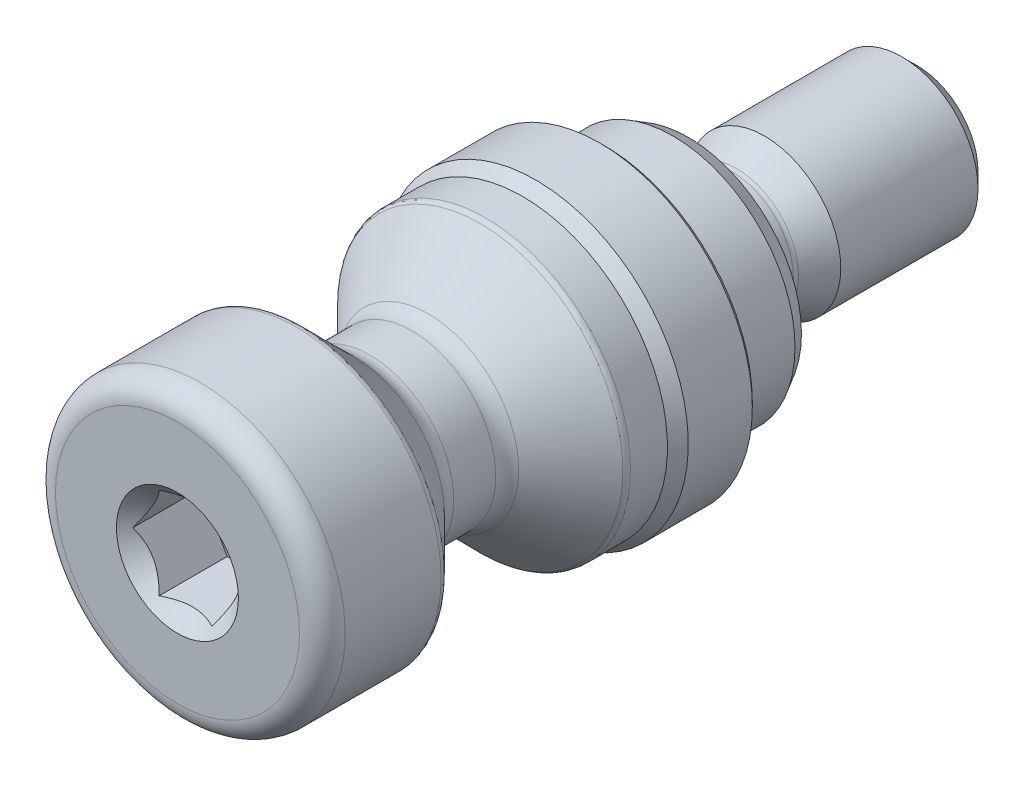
ISO-10303-21;
HEADER;
FILE_DESCRIPTION(('STEP AP214'),'2;1');
FILE_NAME('part.step','',(''),(''),'','','');
FILE_SCHEMA(('AUTOMOTIVE_DESIGN { 1 0 10303 214 1 1 1 1 }'));
ENDSEC;
DATA;
#1=APPLICATION_CONTEXT('core data for automotive mechanical design processes');
#2=APPLICATION_PROTOCOL_DEFINITION('international standard','automotive_design',2000,#1);
#3=PRODUCT_CONTEXT('',#1,'mechanical');
#4=PRODUCT('Part','Part','',(#3));
#5=PRODUCT_RELATED_PRODUCT_CATEGORY('part','',(#4));
#6=PRODUCT_DEFINITION_FORMATION('','',#4);
#7=PRODUCT_DEFINITION_CONTEXT('part definition',#1,'design');
#8=PRODUCT_DEFINITION('design','',#6,#7);
#9=PRODUCT_DEFINITION_SHAPE('','',#8);
#10=(LENGTH_UNIT() NAMED_UNIT(*) SI_UNIT(.MILLI.,.METRE.));
#11=(NAMED_UNIT(*) PLANE_ANGLE_UNIT() SI_UNIT($,.RADIAN.));
#12=(NAMED_UNIT(*) SI_UNIT($,.STERADIAN.) SOLID_ANGLE_UNIT());
#13=UNCERTAINTY_MEASURE_WITH_UNIT(LENGTH_MEASURE(1.E-05),#10,'distance_accuracy_value','');
#14=(GEOMETRIC_REPRESENTATION_CONTEXT(3) GLOBAL_UNCERTAINTY_ASSIGNED_CONTEXT((#13)) GLOBAL_UNIT_ASSIGNED_CONTEXT((#10,
#11,#12)) REPRESENTATION_CONTEXT('',''));
#15=CARTESIAN_POINT('',(0.,0.,0.));
#16=DIRECTION('',(0.,0.,1.));
#17=DIRECTION('',(1.,0.,0.));
#18=AXIS2_PLACEMENT_3D('',#15,#16,#17);
#19=CARTESIAN_POINT('',(0.,0.,-20.5));
#20=DIRECTION('',(0.,0.,-1.));
#21=DIRECTION('',(-1.,0.,0.));
#22=AXIS2_PLACEMENT_3D('',#19,#20,#21);
#23=CYLINDRICAL_SURFACE('',#22,9.5);
#24=CARTESIAN_POINT('',(0.,0.,7.79289321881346));
#25=DIRECTION('',(0.,0.,1.));
#26=DIRECTION('',(1.,0.,0.));
#27=AXIS2_PLACEMENT_3D('',#24,#25,#26);
#28=CIRCLE('',#27,9.5);
#29=CARTESIAN_POINT('',(9.5,0.,7.79289321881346));
#30=VERTEX_POINT('',#29);
#31=EDGE_CURVE('E235',#30,#30,#28,.F.);
#32=ORIENTED_EDGE('',*,*,#31,.T.);
#33=EDGE_LOOP('',(#32));
#34=FACE_BOUND('',#33,.T.);
#35=CARTESIAN_POINT('',(0.,0.,5.36602540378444));
#36=DIRECTION('',(0.,0.,-1.));
#37=DIRECTION('',(-1.,0.,0.));
#38=AXIS2_PLACEMENT_3D('',#35,#36,#37);
#39=CIRCLE('',#38,9.5);
#40=CARTESIAN_POINT('',(-9.5,0.,5.36602540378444));
#41=VERTEX_POINT('',#40);
#42=EDGE_CURVE('E115',#41,#41,#39,.T.);
#43=ORIENTED_EDGE('',*,*,#42,.F.);
#44=EDGE_LOOP('',(#43));
#45=FACE_BOUND('',#44,.T.);
#46=ADVANCED_FACE('F14',(#34,#45),#23,.T.);
#47=CARTESIAN_POINT('',(0.,5.,-5.5));
#48=DIRECTION('',(0.,0.,1.));
#49=DIRECTION('',(1.,0.,0.));
#50=AXIS2_PLACEMENT_3D('',#47,#48,#49);
#51=PLANE('',#50);
#52=CARTESIAN_POINT('',(0.,0.,-5.5));
#53=DIRECTION('',(0.,0.,1.));
#54=DIRECTION('',(1.,0.,0.));
#55=AXIS2_PLACEMENT_3D('',#52,#53,#54);
#56=CIRCLE('',#55,7.42264973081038);
#57=CARTESIAN_POINT('',(7.42264973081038,0.,-5.5));
#58=VERTEX_POINT('',#57);
#59=EDGE_CURVE('E263',#58,#58,#56,.F.);
#60=ORIENTED_EDGE('',*,*,#59,.T.);
#61=EDGE_LOOP('',(#60));
#62=FACE_BOUND('',#61,.T.);
#63=CARTESIAN_POINT('',(0.,0.,-5.5));
#64=DIRECTION('',(0.,0.,1.));
#65=DIRECTION('',(1.,0.,0.));
#66=AXIS2_PLACEMENT_3D('',#63,#64,#65);
#67=CIRCLE('',#66,4.6);
#68=CARTESIAN_POINT('',(4.6,0.,-5.5));
#69=VERTEX_POINT('',#68);
#70=EDGE_CURVE('E309',#69,#69,#67,.T.);
#71=ORIENTED_EDGE('',*,*,#70,.T.);
#72=EDGE_LOOP('',(#71));
#73=FACE_BOUND('',#72,.T.);
#74=ADVANCED_FACE('F202',(#62,#73),#51,.F.);
#75=CARTESIAN_POINT('',(0.,0.,-20.5));
#76=DIRECTION('',(0.,0.,-1.));
#77=DIRECTION('',(-1.,0.,0.));
#78=AXIS2_PLACEMENT_3D('',#75,#76,#77);
#79=CYLINDRICAL_SURFACE('',#78,8.);
#80=CARTESIAN_POINT('',(0.,0.,-4.5));
#81=DIRECTION('',(0.,0.,1.));
#82=DIRECTION('',(1.,0.,0.));
#83=AXIS2_PLACEMENT_3D('',#80,#81,#82);
#84=CIRCLE('',#83,8.);
#85=CARTESIAN_POINT('',(8.,0.,-4.5));
#86=VERTEX_POINT('',#85);
#87=EDGE_CURVE('E266',#86,#86,#84,.T.);
#88=ORIENTED_EDGE('',*,*,#87,.T.);
#89=EDGE_LOOP('',(#88));
#90=FACE_BOUND('',#89,.T.);
#91=CARTESIAN_POINT('',(0.,0.,0.));
#92=DIRECTION('',(0.,0.,-1.));
#93=DIRECTION('',(-1.,0.,0.));
#94=AXIS2_PLACEMENT_3D('',#91,#92,#93);
#95=CIRCLE('',#94,8.);
#96=CARTESIAN_POINT('',(-8.,0.,0.));
#97=VERTEX_POINT('',#96);
#98=EDGE_CURVE('E121',#97,#97,#95,.T.);
#99=ORIENTED_EDGE('',*,*,#98,.T.);
#100=EDGE_LOOP('',(#99));
#101=FACE_BOUND('',#100,.T.);
#102=ADVANCED_FACE('F209',(#90,#101),#79,.T.);
#103=CARTESIAN_POINT('',(0.,8.,0.));
#104=DIRECTION('',(0.,0.,1.));
#105=DIRECTION('',(1.,0.,0.));
#106=AXIS2_PLACEMENT_3D('',#103,#104,#105);
#107=PLANE('',#106);
#108=CARTESIAN_POINT('',(0.,0.,0.));
#109=DIRECTION('',(0.,0.,1.));
#110=DIRECTION('',(1.,0.,0.));
#111=AXIS2_PLACEMENT_3D('',#108,#109,#110);
#112=CIRCLE('',#111,9.7);
#113=CARTESIAN_POINT('',(9.7,0.,0.));
#114=VERTEX_POINT('',#113);
#115=EDGE_CURVE('E269',#114,#114,#112,.F.);
#116=ORIENTED_EDGE('',*,*,#115,.T.);
#117=EDGE_LOOP('',(#116));
#118=FACE_BOUND('',#117,.T.);
#119=ORIENTED_EDGE('',*,*,#98,.F.);
#120=EDGE_LOOP('',(#119));
#121=FACE_BOUND('',#120,.T.);
#122=ADVANCED_FACE('F361',(#118,#121),#107,.F.);
#123=CARTESIAN_POINT('',(0.,0.,-20.5));
#124=DIRECTION('',(0.,0.,-1.));
#125=DIRECTION('',(-1.,0.,0.));
#126=AXIS2_PLACEMENT_3D('',#123,#124,#125);
#127=CYLINDRICAL_SURFACE('',#126,10.);
#128=CARTESIAN_POINT('',(0.,0.,0.300000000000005));
#129=DIRECTION('',(0.,0.,1.));
#130=DIRECTION('',(1.,0.,0.));
#131=AXIS2_PLACEMENT_3D('',#128,#129,#130);
#132=CIRCLE('',#131,10.);
#133=CARTESIAN_POINT('',(10.,0.,0.300000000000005));
#134=VERTEX_POINT('',#133);
#135=EDGE_CURVE('E272',#134,#134,#132,.T.);
#136=ORIENTED_EDGE('',*,*,#135,.T.);
#137=EDGE_LOOP('',(#136));
#138=FACE_BOUND('',#137,.T.);
#139=CARTESIAN_POINT('',(0.,0.,4.5));
#140=DIRECTION('',(0.,0.,-1.));
#141=DIRECTION('',(-1.,0.,0.));
#142=AXIS2_PLACEMENT_3D('',#139,#140,#141);
#143=CIRCLE('',#142,10.);
#144=CARTESIAN_POINT('',(-10.,0.,4.5));
#145=VERTEX_POINT('',#144);
#146=EDGE_CURVE('E118',#145,#145,#143,.T.);
#147=ORIENTED_EDGE('',*,*,#146,.T.);
#148=EDGE_LOOP('',(#147));
#149=FACE_BOUND('',#148,.T.);
#150=ADVANCED_FACE('F366',(#138,#149),#127,.T.);
#151=CARTESIAN_POINT('',(0.,0.,5.36602540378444));
#152=DIRECTION('',(0.,0.,-1.));
#153=DIRECTION('',(-1.,0.,0.));
#154=AXIS2_PLACEMENT_3D('',#151,#152,#153);
#155=CONICAL_SURFACE('',#154,9.5,0.523598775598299);
#156=ORIENTED_EDGE('',*,*,#146,.F.);
#157=EDGE_LOOP('',(#156));
#158=FACE_BOUND('',#157,.T.);
#159=ORIENTED_EDGE('',*,*,#42,.T.);
#160=EDGE_LOOP('',(#159));
#161=FACE_BOUND('',#160,.T.);
#162=ADVANCED_FACE('F372',(#158,#161),#155,.T.);
#163=CARTESIAN_POINT('',(0.,0.,8.));
#164=DIRECTION('',(0.,0.,-1.));
#165=DIRECTION('',(-1.,0.,0.));
#166=AXIS2_PLACEMENT_3D('',#163,#164,#165);
#167=CONICAL_SURFACE('',#166,9.5,0.78539816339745);
#168=CARTESIAN_POINT('',(0.,0.,11.5606601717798));
#169=DIRECTION('',(0.,0.,-1.));
#170=DIRECTION('',(-1.,0.,0.));
#171=AXIS2_PLACEMENT_3D('',#168,#169,#170);
#172=CIRCLE('',#171,5.93933982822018);
#173=CARTESIAN_POINT('',(-5.93933982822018,0.,11.5606601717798));
#174=VERTEX_POINT('',#173);
#175=EDGE_CURVE('E247',#174,#174,#172,.T.);
#176=ORIENTED_EDGE('',*,*,#175,.T.);
#177=EDGE_LOOP('',(#176));
#178=FACE_BOUND('',#177,.T.);
#179=CARTESIAN_POINT('',(0.,0.,8.14644660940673));
#180=DIRECTION('',(0.,0.,-1.));
#181=DIRECTION('',(-1.,0.,0.));
#182=AXIS2_PLACEMENT_3D('',#179,#180,#181);
#183=CIRCLE('',#182,9.35355339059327);
#184=CARTESIAN_POINT('',(-9.35355339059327,0.,8.14644660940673));
#185=VERTEX_POINT('',#184);
#186=EDGE_CURVE('E238',#185,#185,#183,.F.);
#187=ORIENTED_EDGE('',*,*,#186,.T.);
#188=EDGE_LOOP('',(#187));
#189=FACE_BOUND('',#188,.T.);
#190=ADVANCED_FACE('F376',(#178,#189),#167,.T.);
#191=CARTESIAN_POINT('',(0.,0.,0.));
#192=DIRECTION('',(0.,0.,-1.));
#193=DIRECTION('',(-1.,0.,0.));
#194=AXIS2_PLACEMENT_3D('',#191,#192,#193);
#195=CYLINDRICAL_SURFACE('',#194,5.5);
#196=CARTESIAN_POINT('',(0.,0.,12.6213203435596));
#197=DIRECTION('',(0.,0.,-1.));
#198=DIRECTION('',(-1.,0.,0.));
#199=AXIS2_PLACEMENT_3D('',#196,#197,#198);
#200=CIRCLE('',#199,5.5);
#201=CARTESIAN_POINT('',(-5.5,0.,12.6213203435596));
#202=VERTEX_POINT('',#201);
#203=EDGE_CURVE('E253',#202,#202,#200,.F.);
#204=ORIENTED_EDGE('',*,*,#203,.T.);
#205=EDGE_LOOP('',(#204));
#206=FACE_BOUND('',#205,.T.);
#207=CARTESIAN_POINT('',(0.,0.,15.3786796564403));
#208=DIRECTION('',(0.,0.,-1.));
#209=DIRECTION('',(-1.,0.,0.));
#210=AXIS2_PLACEMENT_3D('',#207,#208,#209);
#211=CIRCLE('',#210,5.5);
#212=CARTESIAN_POINT('',(-5.5,0.,15.3786796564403));
#213=VERTEX_POINT('',#212);
#214=EDGE_CURVE('E250',#213,#213,#211,.T.);
#215=ORIENTED_EDGE('',*,*,#214,.T.);
#216=EDGE_LOOP('',(#215));
#217=FACE_BOUND('',#216,.T.);
#218=ADVANCED_FACE('F381',(#206,#217),#195,.T.);
#219=CARTESIAN_POINT('',(0.,0.,16.));
#220=DIRECTION('',(0.,0.,1.));
#221=DIRECTION('',(1.,0.,0.));
#222=AXIS2_PLACEMENT_3D('',#219,#220,#221);
#223=CONICAL_SURFACE('',#222,5.5,0.78539816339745);
#224=CARTESIAN_POINT('',(0.,0.,16.4393398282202));
#225=DIRECTION('',(0.,0.,1.));
#226=DIRECTION('',(1.,0.,0.));
#227=AXIS2_PLACEMENT_3D('',#224,#225,#226);
#228=CIRCLE('',#227,5.93933982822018);
#229=CARTESIAN_POINT('',(5.93933982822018,0.,16.4393398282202));
#230=VERTEX_POINT('',#229);
#231=EDGE_CURVE('E256',#230,#230,#228,.T.);
#232=ORIENTED_EDGE('',*,*,#231,.T.);
#233=EDGE_LOOP('',(#232));
#234=FACE_BOUND('',#233,.T.);
#235=CARTESIAN_POINT('',(0.,0.,19.8535533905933));
#236=DIRECTION('',(0.,0.,1.));
#237=DIRECTION('',(1.,0.,0.));
#238=AXIS2_PLACEMENT_3D('',#235,#236,#237);
#239=CIRCLE('',#238,9.35355339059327);
#240=CARTESIAN_POINT('',(9.35355339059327,0.,19.8535533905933));
#241=VERTEX_POINT('',#240);
#242=EDGE_CURVE('E236',#241,#241,#239,.F.);
#243=ORIENTED_EDGE('',*,*,#242,.T.);
#244=EDGE_LOOP('',(#243));
#245=FACE_BOUND('',#244,.T.);
#246=ADVANCED_FACE('F225',(#234,#245),#223,.T.);
#247=CARTESIAN_POINT('',(0.,9.5,28.));
#248=DIRECTION('',(0.,0.,-1.));
#249=DIRECTION('',(-1.,0.,0.));
#250=AXIS2_PLACEMENT_3D('',#247,#248,#249);
#251=PLANE('',#250);
#252=CARTESIAN_POINT('',(0.,0.,28.));
#253=DIRECTION('',(0.,0.,-1.));
#254=DIRECTION('',(-1.,0.,0.));
#255=AXIS2_PLACEMENT_3D('',#252,#253,#254);
#256=CIRCLE('',#255,8.);
#257=CARTESIAN_POINT('',(-8.,0.,28.));
#258=VERTEX_POINT('',#257);
#259=EDGE_CURVE('E260',#258,#258,#256,.F.);
#260=ORIENTED_EDGE('',*,*,#259,.T.);
#261=EDGE_LOOP('',(#260));
#262=FACE_BOUND('',#261,.T.);
#263=CARTESIAN_POINT('',(0.,0.,28.));
#264=DIRECTION('',(0.,0.,1.));
#265=DIRECTION('',(1.,0.,0.));
#266=AXIS2_PLACEMENT_3D('',#263,#264,#265);
#267=CIRCLE('',#266,4.);
#268=CARTESIAN_POINT('',(4.,0.,28.));
#269=VERTEX_POINT('',#268);
#270=EDGE_CURVE('E100',#269,#269,#267,.T.);
#271=ORIENTED_EDGE('',*,*,#270,.F.);
#272=EDGE_LOOP('',(#271));
#273=FACE_BOUND('',#272,.T.);
#274=ADVANCED_FACE('F218',(#262,#273),#251,.F.);
#275=CARTESIAN_POINT('',(0.,0.,26.5));
#276=DIRECTION('',(0.,0.,-1.));
#277=DIRECTION('',(-1.,0.,0.));
#278=AXIS2_PLACEMENT_3D('',#275,#276,#277);
#279=CIRCLE('',#278,9.5);
#280=CARTESIAN_POINT('',(-9.5,0.,26.5));
#281=VERTEX_POINT('',#280);
#282=EDGE_CURVE('E230',#281,#281,#279,.T.);
#283=ORIENTED_EDGE('',*,*,#282,.T.);
#284=EDGE_LOOP('',(#283));
#285=FACE_BOUND('',#284,.T.);
#286=CARTESIAN_POINT('',(0.,0.,20.2071067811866));
#287=DIRECTION('',(0.,0.,1.));
#288=DIRECTION('',(1.,0.,0.));
#289=AXIS2_PLACEMENT_3D('',#286,#287,#288);
#290=CIRCLE('',#289,9.5);
#291=CARTESIAN_POINT('',(9.5,0.,20.2071067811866));
#292=VERTEX_POINT('',#291);
#293=EDGE_CURVE('E233',#292,#292,#290,.T.);
#294=ORIENTED_EDGE('',*,*,#293,.T.);
#295=EDGE_LOOP('',(#294));
#296=FACE_BOUND('',#295,.T.);
#297=ADVANCED_FACE('F205',(#285,#296),#23,.T.);
#298=CARTESIAN_POINT('',(0.,0.,0.));
#299=DIRECTION('',(0.,0.,1.));
#300=DIRECTION('',(1.,0.,0.));
#301=AXIS2_PLACEMENT_3D('',#298,#299,#300);
#302=CYLINDRICAL_SURFACE('',#301,4.);
#303=CARTESIAN_POINT('',(0.,0.,-6.1));
#304=DIRECTION('',(0.,0.,1.));
#305=DIRECTION('',(1.,0.,0.));
#306=AXIS2_PLACEMENT_3D('',#303,#304,#305);
#307=CIRCLE('',#306,4.);
#308=CARTESIAN_POINT('',(4.,0.,-6.1));
#309=VERTEX_POINT('',#308);
#310=EDGE_CURVE('E303',#309,#309,#307,.F.);
#311=ORIENTED_EDGE('',*,*,#310,.T.);
#312=EDGE_LOOP('',(#311));
#313=FACE_BOUND('',#312,.T.);
#314=CARTESIAN_POINT('',(0.,0.,-8.39334223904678));
#315=DIRECTION('',(0.,0.,1.));
#316=DIRECTION('',(1.,0.,0.));
#317=AXIS2_PLACEMENT_3D('',#314,#315,#316);
#318=CIRCLE('',#317,4.);
#319=CARTESIAN_POINT('',(4.,0.,-8.39334223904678));
#320=VERTEX_POINT('',#319);
#321=EDGE_CURVE('E305',#320,#320,#318,.T.);
#322=ORIENTED_EDGE('',*,*,#321,.T.);
#323=EDGE_LOOP('',(#322));
#324=FACE_BOUND('',#323,.T.);
#325=ADVANCED_FACE('F217',(#313,#324),#302,.T.);
#326=CARTESIAN_POINT('',(0.,0.,-10.5));
#327=DIRECTION('',(0.,0.,-1.));
#328=DIRECTION('',(-1.,0.,0.));
#329=AXIS2_PLACEMENT_3D('',#326,#327,#328);
#330=CONICAL_SURFACE('',#329,5.,0.47123889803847);
#331=CARTESIAN_POINT('',(0.,0.,-8.66573653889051));
#332=DIRECTION('',(0.,0.,-1.));
#333=DIRECTION('',(-1.,0.,0.));
#334=AXIS2_PLACEMENT_3D('',#331,#332,#333);
#335=CIRCLE('',#334,4.06539608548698);
#336=CARTESIAN_POINT('',(-4.06539608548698,0.,-8.66573653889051));
#337=VERTEX_POINT('',#336);
#338=EDGE_CURVE('E241',#337,#337,#335,.T.);
#339=ORIENTED_EDGE('',*,*,#338,.T.);
#340=EDGE_LOOP('',(#339));
#341=FACE_BOUND('',#340,.T.);
#342=CARTESIAN_POINT('',(0.,0.,-10.5));
#343=DIRECTION('',(0.,0.,1.));
#344=DIRECTION('',(1.,0.,0.));
#345=AXIS2_PLACEMENT_3D('',#342,#343,#344);
#346=CIRCLE('',#345,5.);
#347=CARTESIAN_POINT('',(5.,0.,-10.5));
#348=VERTEX_POINT('',#347);
#349=EDGE_CURVE('E112',#348,#348,#346,.T.);
#350=ORIENTED_EDGE('',*,*,#349,.T.);
#351=EDGE_LOOP('',(#350));
#352=FACE_BOUND('',#351,.T.);
#353=ADVANCED_FACE('F148',(#341,#352),#330,.T.);
#354=CARTESIAN_POINT('',(0.,0.,-20.5));
#355=DIRECTION('',(0.,0.,1.));
#356=DIRECTION('',(1.,0.,0.));
#357=AXIS2_PLACEMENT_3D('',#354,#355,#356);
#358=PLANE('',#357);
#359=CARTESIAN_POINT('',(0.,0.,-20.5));
#360=DIRECTION('',(0.,0.,1.));
#361=DIRECTION('',(1.,0.,0.));
#362=AXIS2_PLACEMENT_3D('',#359,#360,#361);
#363=CIRCLE('',#362,4.);
#364=CARTESIAN_POINT('',(4.,0.,-20.5));
#365=VERTEX_POINT('',#364);
#366=EDGE_CURVE('E22',#365,#365,#363,.F.);
#367=ORIENTED_EDGE('',*,*,#366,.T.);
#368=EDGE_LOOP('',(#367));
#369=FACE_BOUND('',#368,.T.);
#370=ADVANCED_FACE('F277',(#369),#358,.F.);
#371=CARTESIAN_POINT('',(0.,0.,-20.5));
#372=DIRECTION('',(0.,0.,-1.));
#373=DIRECTION('',(-1.,0.,0.));
#374=AXIS2_PLACEMENT_3D('',#371,#372,#373);
#375=CYLINDRICAL_SURFACE('',#374,5.);
#376=CARTESIAN_POINT('',(0.,0.,-19.5));
#377=DIRECTION('',(0.,0.,1.));
#378=DIRECTION('',(1.,0.,0.));
#379=AXIS2_PLACEMENT_3D('',#376,#377,#378);
#380=CIRCLE('',#379,5.);
#381=CARTESIAN_POINT('',(5.,0.,-19.5));
#382=VERTEX_POINT('',#381);
#383=EDGE_CURVE('E9',#382,#382,#380,.T.);
#384=ORIENTED_EDGE('',*,*,#383,.T.);
#385=EDGE_LOOP('',(#384));
#386=FACE_BOUND('',#385,.T.);
#387=ORIENTED_EDGE('',*,*,#349,.F.);
#388=EDGE_LOOP('',(#387));
#389=FACE_BOUND('',#388,.T.);
#390=ADVANCED_FACE('F145',(#386,#389),#375,.T.);
#391=CARTESIAN_POINT('',(0.,0.,28.));
#392=DIRECTION('',(0.,0.,1.));
#393=DIRECTION('',(1.,0.,0.));
#394=AXIS2_PLACEMENT_3D('',#391,#392,#393);
#395=CONICAL_SURFACE('',#394,4.,0.785398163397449);
#396=CARTESIAN_POINT('',(4.31417090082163,3.,29.2547188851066));
#397=CARTESIAN_POINT('',(4.20556655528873,3.,29.1655763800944));
#398=CARTESIAN_POINT('',(4.09644055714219,3.,29.0770594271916));
#399=CARTESIAN_POINT('',(3.87687889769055,3.,28.9016089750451));
#400=CARTESIAN_POINT('',(3.76644291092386,3.,28.8146758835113));
#401=CARTESIAN_POINT('',(3.5428272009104,3.,28.6418260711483));
#402=CARTESIAN_POINT('',(3.42963066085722,3.,28.5559310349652));
#403=CARTESIAN_POINT('',(3.20137110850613,3.,28.3866739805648));
#404=CARTESIAN_POINT('',(3.08630827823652,3.,28.3033117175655));
#405=CARTESIAN_POINT('',(2.84299675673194,3.,28.1321251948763));
#406=CARTESIAN_POINT('',(2.71452444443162,3.,28.0446169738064));
#407=CARTESIAN_POINT('',(2.45417043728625,3.,27.8746889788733));
#408=CARTESIAN_POINT('',(2.32228764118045,3.,27.7922708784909));
#409=CARTESIAN_POINT('',(2.05500752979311,3.,27.6347549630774));
#410=CARTESIAN_POINT('',(1.91962937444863,3.,27.5596249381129));
#411=CARTESIAN_POINT('',(1.64405080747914,3.,27.418900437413));
#412=CARTESIAN_POINT('',(1.50385471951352,3.,27.3532976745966));
#413=CARTESIAN_POINT('',(1.25928424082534,3.,27.2522685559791));
#414=CARTESIAN_POINT('',(1.15625925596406,3.,27.2135991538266));
#415=CARTESIAN_POINT('',(0.947418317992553,3.,27.1445027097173));
#416=CARTESIAN_POINT('',(0.841601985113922,3.,27.1140767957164));
#417=CARTESIAN_POINT('',(0.629948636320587,3.,27.0637428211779));
#418=CARTESIAN_POINT('',(0.524164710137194,3.,27.0436153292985));
#419=CARTESIAN_POINT('',(0.311086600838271,3.,27.0142427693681));
#420=CARTESIAN_POINT('',(0.203792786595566,3.,27.0049950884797));
#421=CARTESIAN_POINT('',(-0.00553816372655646,3.,26.9982768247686));
#422=CARTESIAN_POINT('',(-0.107556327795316,3.,27.0002148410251));
#423=CARTESIAN_POINT('',(-0.310871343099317,3.,27.0143576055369));
#424=CARTESIAN_POINT('',(-0.412168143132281,3.,27.0265630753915));
#425=CARTESIAN_POINT('',(-0.615080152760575,3.,27.0607380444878));
#426=CARTESIAN_POINT('',(-0.716663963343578,3.,27.0828909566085));
#427=CARTESIAN_POINT('',(-0.917551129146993,3.,27.1356827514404));
#428=CARTESIAN_POINT('',(-1.01685452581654,3.,27.1663214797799));
#429=CARTESIAN_POINT('',(-1.31591155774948,3.,27.2704779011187));
#430=CARTESIAN_POINT('',(-1.5117516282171,3.,27.3552582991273));
#431=CARTESIAN_POINT('',(-1.79840284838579,3.,27.4967635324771));
#432=CARTESIAN_POINT('',(-1.89294095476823,3.,27.5464289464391));
#433=CARTESIAN_POINT('',(-2.07988299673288,3.,27.6496345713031));
#434=CARTESIAN_POINT('',(-2.17228729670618,3.,27.703174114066));
#435=CARTESIAN_POINT('',(-2.3506857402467,3.,27.8106312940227));
#436=CARTESIAN_POINT('',(-2.43677095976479,3.,27.8643994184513));
#437=CARTESIAN_POINT('',(-2.60746404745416,3.,27.9742424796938));
#438=CARTESIAN_POINT('',(-2.69207180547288,3.,28.0303175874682));
#439=CARTESIAN_POINT('',(-2.85932644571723,3.,28.143911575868));
#440=CARTESIAN_POINT('',(-2.94198356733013,3.,28.2014154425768));
#441=CARTESIAN_POINT('',(-3.10616146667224,3.,28.3179776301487));
#442=CARTESIAN_POINT('',(-3.18768255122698,3.,28.377035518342));
#443=CARTESIAN_POINT('',(-3.26872675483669,3.,28.436730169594));
#444=B_SPLINE_CURVE_WITH_KNOTS('',3,(#396,#397,#398,#399,#400,#401,#402,#403,#404,#405,#406,
#407,#408,#409,#410,#411,#412,#413,#414,#415,#416,#417,#418,#419,#420,#421,#422,#423,#424,#425,
#426,#427,#428,#429,#430,#431,#432,#433,#434,#435,#436,#437,#438,#439,#440,#441,#442,#443),
.UNSPECIFIED.,.F.,.F.,(4,2,2,2,2,2,2,2,2,2,2,2,2,2,2,2,2,2,2,2,2,2,2,4),(0.,0.421518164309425,
0.84314334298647,1.26940433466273,1.69562399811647,2.16186559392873,2.62825966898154,
3.09248837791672,3.55631083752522,3.88616498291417,4.21606423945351,4.53860624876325,
4.86107078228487,5.16664793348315,5.47224656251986,5.78372724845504,6.09520226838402,
6.73345011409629,7.05379152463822,7.37407781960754,7.67853185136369,7.9830084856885,
8.28506559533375,8.58703947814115),.UNSPECIFIED.);
#445=CARTESIAN_POINT('',(-1.73205080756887,3.,27.4641016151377));
#446=VERTEX_POINT('',#445);
#447=CARTESIAN_POINT('',(1.73205080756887,3.,27.4641016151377));
#448=VERTEX_POINT('',#447);
#449=EDGE_CURVE('E124',#446,#448,#444,.F.);
#450=ORIENTED_EDGE('',*,*,#449,.T.);
#451=CARTESIAN_POINT('',(1.73193533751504,3.0002,27.4642170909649));
#452=CARTESIAN_POINT('',(1.79147372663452,2.89707648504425,27.4047299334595));
#453=CARTESIAN_POINT('',(1.85200767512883,2.79222861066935,27.3487365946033));
#454=CARTESIAN_POINT('',(1.97544301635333,2.57843232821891,27.2462142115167));
#455=CARTESIAN_POINT('',(2.03835614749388,2.46946358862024,27.199742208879));
#456=CARTESIAN_POINT('',(2.16521745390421,2.24973336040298,27.1201348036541));
#457=CARTESIAN_POINT('',(2.22913332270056,2.13902782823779,27.0867993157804));
#458=CARTESIAN_POINT('',(2.35837216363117,1.91517958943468,27.0354391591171));
#459=CARTESIAN_POINT('',(2.42369118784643,1.80204372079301,27.0173761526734));
#460=CARTESIAN_POINT('',(2.53626564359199,1.6070590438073,27.0010785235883));
#461=CARTESIAN_POINT('',(2.58337569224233,1.52546204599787,26.9986659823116));
#462=CARTESIAN_POINT('',(2.67751916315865,1.36240077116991,27.0027310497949));
#463=CARTESIAN_POINT('',(2.72455255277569,1.28093655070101,27.0092117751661));
#464=CARTESIAN_POINT('',(2.81817374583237,1.11877988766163,27.030693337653));
#465=CARTESIAN_POINT('',(2.86476099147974,1.0380884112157,27.045703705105));
#466=CARTESIAN_POINT('',(2.95713536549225,0.878091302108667,27.0834252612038));
#467=CARTESIAN_POINT('',(3.00292255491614,0.798785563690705,27.1061358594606));
#468=CARTESIAN_POINT('',(3.0842086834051,0.65799385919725,27.1528622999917));
#469=CARTESIAN_POINT('',(3.11988753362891,0.596196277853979,27.1756499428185));
#470=CARTESIAN_POINT('',(3.19060468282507,0.473710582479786,27.2248979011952));
#471=CARTESIAN_POINT('',(3.22564296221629,0.413022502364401,27.2513583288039));
#472=CARTESIAN_POINT('',(3.29496858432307,0.29294700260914,27.3073586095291));
#473=CARTESIAN_POINT('',(3.3292578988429,0.233556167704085,27.3368887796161));
#474=CARTESIAN_POINT('',(3.39720147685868,0.115874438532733,27.3986407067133));
#475=CARTESIAN_POINT('',(3.43085611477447,0.0575828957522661,27.4308608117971));
#476=CARTESIAN_POINT('',(3.4642170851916,-0.0002000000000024,27.4642170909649));
#477=B_SPLINE_CURVE_WITH_KNOTS('',3,(#451,#452,#453,#454,#455,#456,#457,#458,#459,#460,#461,
#462,#463,#464,#465,#466,#467,#468,#469,#470,#471,#472,#473,#474,#475,#476),.UNSPECIFIED.,.F.,
.F.,(4,2,2,2,2,2,2,2,2,2,2,2,4),(0.,0.399603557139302,0.801535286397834,1.19708369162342,
1.59163620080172,1.87398941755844,2.15644160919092,2.43921001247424,2.72195674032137,
2.94657516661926,3.17120044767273,3.39513752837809,3.61893808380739),.UNSPECIFIED.);
#478=CARTESIAN_POINT('',(3.46410161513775,0.,27.4641016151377));
#479=VERTEX_POINT('',#478);
#480=EDGE_CURVE('E72',#448,#479,#477,.T.);
#481=ORIENTED_EDGE('',*,*,#480,.T.);
#482=CARTESIAN_POINT('',(3.4642170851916,0.000199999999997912,27.4642170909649));
#483=CARTESIAN_POINT('',(3.40467869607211,-0.102923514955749,27.4047299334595));
#484=CARTESIAN_POINT('',(3.3441447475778,-0.20777138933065,27.3487365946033));
#485=CARTESIAN_POINT('',(3.2207094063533,-0.421567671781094,27.2462142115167));
#486=CARTESIAN_POINT('',(3.15779627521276,-0.530536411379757,27.1997422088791));
#487=CARTESIAN_POINT('',(3.03093496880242,-0.750266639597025,27.1201348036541));
#488=CARTESIAN_POINT('',(2.96701910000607,-0.860972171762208,27.0867993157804));
#489=CARTESIAN_POINT('',(2.83778025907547,-1.08482041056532,27.0354391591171));
#490=CARTESIAN_POINT('',(2.77246123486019,-1.19795627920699,27.0173761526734));
#491=CARTESIAN_POINT('',(2.65988677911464,-1.3929409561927,27.0010785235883));
#492=CARTESIAN_POINT('',(2.6127767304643,-1.47453795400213,26.9986659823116));
#493=CARTESIAN_POINT('',(2.51863325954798,-1.63759922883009,27.0027310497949));
#494=CARTESIAN_POINT('',(2.47159986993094,-1.71906344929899,27.0092117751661));
#495=CARTESIAN_POINT('',(2.37797867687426,-1.88122011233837,27.030693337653));
#496=CARTESIAN_POINT('',(2.3313914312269,-1.9619115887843,27.045703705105));
#497=CARTESIAN_POINT('',(2.23901705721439,-2.12190869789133,27.0834252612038));
#498=CARTESIAN_POINT('',(2.19322986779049,-2.2012144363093,27.1061358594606));
#499=CARTESIAN_POINT('',(2.11194373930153,-2.34200614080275,27.1528622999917));
#500=CARTESIAN_POINT('',(2.07626488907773,-2.40380372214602,27.1756499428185));
#501=CARTESIAN_POINT('',(2.00554773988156,-2.52628941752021,27.2248979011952));
#502=CARTESIAN_POINT('',(1.97050946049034,-2.5869774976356,27.251358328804));
#503=CARTESIAN_POINT('',(1.90118383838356,-2.70705299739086,27.3073586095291));
#504=CARTESIAN_POINT('',(1.86689452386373,-2.76644383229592,27.3368887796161));
#505=CARTESIAN_POINT('',(1.79895094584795,-2.88412556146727,27.3986407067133));
#506=CARTESIAN_POINT('',(1.76529630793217,-2.94241710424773,27.4308608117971));
#507=CARTESIAN_POINT('',(1.73193533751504,-3.0002,27.4642170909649));
#508=B_SPLINE_CURVE_WITH_KNOTS('',3,(#482,#483,#484,#485,#486,#487,#488,#489,#490,#491,#492,
#493,#494,#495,#496,#497,#498,#499,#500,#501,#502,#503,#504,#505,#506,#507),.UNSPECIFIED.,.F.,
.F.,(4,2,2,2,2,2,2,2,2,2,2,2,4),(0.,0.399603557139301,0.801535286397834,1.19708369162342,
1.59163620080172,1.87398941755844,2.15644160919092,2.43921001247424,2.72195674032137,
2.94657516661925,3.17120044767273,3.39513752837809,3.61893808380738),.UNSPECIFIED.);
#509=CARTESIAN_POINT('',(1.73205080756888,-3.,27.4641016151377));
#510=VERTEX_POINT('',#509);
#511=EDGE_CURVE('E37',#479,#510,#508,.T.);
#512=ORIENTED_EDGE('',*,*,#511,.T.);
#513=CARTESIAN_POINT('',(4.31417090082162,-3.,29.2547188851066));
#514=CARTESIAN_POINT('',(4.20556655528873,-3.,29.1655763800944));
#515=CARTESIAN_POINT('',(4.09644055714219,-3.,29.0770594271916));
#516=CARTESIAN_POINT('',(3.87687889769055,-3.,28.9016089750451));
#517=CARTESIAN_POINT('',(3.76644291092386,-3.,28.8146758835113));
#518=CARTESIAN_POINT('',(3.5428272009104,-3.,28.6418260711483));
#519=CARTESIAN_POINT('',(3.42963066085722,-3.,28.5559310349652));
#520=CARTESIAN_POINT('',(3.20137110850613,-3.,28.3866739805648));
#521=CARTESIAN_POINT('',(3.08630827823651,-3.,28.3033117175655));
#522=CARTESIAN_POINT('',(2.84299675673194,-3.,28.1321251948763));
#523=CARTESIAN_POINT('',(2.71452444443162,-3.,28.0446169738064));
#524=CARTESIAN_POINT('',(2.45417043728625,-3.,27.8746889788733));
#525=CARTESIAN_POINT('',(2.32228764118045,-3.,27.7922708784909));
#526=CARTESIAN_POINT('',(2.0550075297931,-3.,27.6347549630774));
#527=CARTESIAN_POINT('',(1.91962937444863,-3.,27.5596249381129));
#528=CARTESIAN_POINT('',(1.64405080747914,-3.,27.418900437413));
#529=CARTESIAN_POINT('',(1.50385471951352,-3.,27.3532976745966));
#530=CARTESIAN_POINT('',(1.25928424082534,-3.,27.2522685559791));
#531=CARTESIAN_POINT('',(1.15625925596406,-3.,27.2135991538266));
#532=CARTESIAN_POINT('',(0.947418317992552,-3.,27.1445027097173));
#533=CARTESIAN_POINT('',(0.841601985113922,-3.,27.1140767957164));
#534=CARTESIAN_POINT('',(0.629948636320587,-3.,27.0637428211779));
#535=CARTESIAN_POINT('',(0.524164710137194,-3.,27.0436153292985));
#536=CARTESIAN_POINT('',(0.311086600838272,-3.,27.0142427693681));
#537=CARTESIAN_POINT('',(0.203792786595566,-3.,27.0049950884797));
#538=CARTESIAN_POINT('',(-0.00553816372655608,-3.,26.9982768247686));
#539=CARTESIAN_POINT('',(-0.107556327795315,-3.,27.0002148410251));
#540=CARTESIAN_POINT('',(-0.310871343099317,-3.,27.0143576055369));
#541=CARTESIAN_POINT('',(-0.41216814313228,-3.,27.0265630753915));
#542=CARTESIAN_POINT('',(-0.615080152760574,-3.,27.0607380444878));
#543=CARTESIAN_POINT('',(-0.716663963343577,-3.,27.0828909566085));
#544=CARTESIAN_POINT('',(-0.917551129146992,-3.,27.1356827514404));
#545=CARTESIAN_POINT('',(-1.01685452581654,-3.,27.1663214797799));
#546=CARTESIAN_POINT('',(-1.31591155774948,-3.,27.2704779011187));
#547=CARTESIAN_POINT('',(-1.51175162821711,-3.,27.3552582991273));
#548=CARTESIAN_POINT('',(-1.79840284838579,-3.,27.4967635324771));
#549=CARTESIAN_POINT('',(-1.89294095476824,-3.,27.5464289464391));
#550=CARTESIAN_POINT('',(-2.07988299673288,-3.,27.6496345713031));
#551=CARTESIAN_POINT('',(-2.17228729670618,-3.,27.703174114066));
#552=CARTESIAN_POINT('',(-2.3506857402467,-3.,27.8106312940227));
#553=CARTESIAN_POINT('',(-2.43677095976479,-3.,27.8643994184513));
#554=CARTESIAN_POINT('',(-2.60746404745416,-3.,27.9742424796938));
#555=CARTESIAN_POINT('',(-2.69207180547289,-3.,28.0303175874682));
#556=CARTESIAN_POINT('',(-2.85932644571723,-3.,28.143911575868));
#557=CARTESIAN_POINT('',(-2.94198356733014,-3.,28.2014154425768));
#558=CARTESIAN_POINT('',(-3.10616146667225,-3.,28.3179776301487));
#559=CARTESIAN_POINT('',(-3.18768255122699,-3.,28.377035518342));
#560=CARTESIAN_POINT('',(-3.2687267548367,-3.,28.436730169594));
#561=B_SPLINE_CURVE_WITH_KNOTS('',3,(#513,#514,#515,#516,#517,#518,#519,#520,#521,#522,#523,
#524,#525,#526,#527,#528,#529,#530,#531,#532,#533,#534,#535,#536,#537,#538,#539,#540,#541,#542,
#543,#544,#545,#546,#547,#548,#549,#550,#551,#552,#553,#554,#555,#556,#557,#558,#559,#560),
.UNSPECIFIED.,.F.,.F.,(4,2,2,2,2,2,2,2,2,2,2,2,2,2,2,2,2,2,2,2,2,2,2,4),(0.,0.421518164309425,
0.843143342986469,1.26940433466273,1.69562399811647,2.16186559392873,2.62825966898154,
3.09248837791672,3.55631083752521,3.88616498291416,4.21606423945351,4.53860624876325,
4.86107078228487,5.16664793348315,5.47224656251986,5.78372724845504,6.09520226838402,
6.73345011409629,7.05379152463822,7.37407781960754,7.67853185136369,7.98300848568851,
8.28506559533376,8.58703947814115),.UNSPECIFIED.);
#562=CARTESIAN_POINT('',(-1.73205080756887,-3.,27.4641016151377));
#563=VERTEX_POINT('',#562);
#564=EDGE_CURVE('E163',#510,#563,#561,.T.);
#565=ORIENTED_EDGE('',*,*,#564,.T.);
#566=CARTESIAN_POINT('',(-1.73193533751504,-3.0002,27.4642170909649));
#567=CARTESIAN_POINT('',(-1.79147372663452,-2.89707648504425,27.4047299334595));
#568=CARTESIAN_POINT('',(-1.85200767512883,-2.79222861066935,27.3487365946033));
#569=CARTESIAN_POINT('',(-1.97544301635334,-2.57843232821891,27.2462142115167));
#570=CARTESIAN_POINT('',(-2.03835614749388,-2.46946358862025,27.1997422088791));
#571=CARTESIAN_POINT('',(-2.16521745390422,-2.24973336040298,27.1201348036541));
#572=CARTESIAN_POINT('',(-2.22913332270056,-2.1390278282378,27.0867993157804));
#573=CARTESIAN_POINT('',(-2.35837216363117,-1.91517958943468,27.0354391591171));
#574=CARTESIAN_POINT('',(-2.42369118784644,-1.80204372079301,27.0173761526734));
#575=CARTESIAN_POINT('',(-2.53626564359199,-1.6070590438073,27.0010785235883));
#576=CARTESIAN_POINT('',(-2.58337569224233,-1.52546204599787,26.9986659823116));
#577=CARTESIAN_POINT('',(-2.67751916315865,-1.36240077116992,27.0027310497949));
#578=CARTESIAN_POINT('',(-2.72455255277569,-1.28093655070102,27.0092117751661));
#579=CARTESIAN_POINT('',(-2.81817374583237,-1.11877988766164,27.030693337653));
#580=CARTESIAN_POINT('',(-2.86476099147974,-1.0380884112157,27.045703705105));
#581=CARTESIAN_POINT('',(-2.95713536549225,-0.878091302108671,27.0834252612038));
#582=CARTESIAN_POINT('',(-3.00292255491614,-0.798785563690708,27.1061358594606));
#583=CARTESIAN_POINT('',(-3.0842086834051,-0.657993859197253,27.1528622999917));
#584=CARTESIAN_POINT('',(-3.11988753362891,-0.596196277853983,27.1756499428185));
#585=CARTESIAN_POINT('',(-3.19060468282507,-0.473710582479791,27.2248979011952));
#586=CARTESIAN_POINT('',(-3.22564296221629,-0.413022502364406,27.2513583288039));
#587=CARTESIAN_POINT('',(-3.29496858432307,-0.292947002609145,27.3073586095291));
#588=CARTESIAN_POINT('',(-3.3292578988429,-0.233556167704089,27.3368887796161));
#589=CARTESIAN_POINT('',(-3.39720147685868,-0.115874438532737,27.3986407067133));
#590=CARTESIAN_POINT('',(-3.43085611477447,-0.0575828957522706,27.4308608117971));
#591=CARTESIAN_POINT('',(-3.4642170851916,0.000199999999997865,27.4642170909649));
#592=B_SPLINE_CURVE_WITH_KNOTS('',3,(#566,#567,#568,#569,#570,#571,#572,#573,#574,#575,#576,
#577,#578,#579,#580,#581,#582,#583,#584,#585,#586,#587,#588,#589,#590,#591),.UNSPECIFIED.,.F.,
.F.,(4,2,2,2,2,2,2,2,2,2,2,2,4),(0.,0.399603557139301,0.801535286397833,1.19708369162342,
1.59163620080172,1.87398941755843,2.15644160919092,2.43921001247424,2.72195674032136,
2.94657516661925,3.17120044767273,3.39513752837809,3.61893808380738),.UNSPECIFIED.);
#593=CARTESIAN_POINT('',(-3.46410161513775,0.,27.4641016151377));
#594=VERTEX_POINT('',#593);
#595=EDGE_CURVE('E156',#563,#594,#592,.T.);
#596=ORIENTED_EDGE('',*,*,#595,.T.);
#597=CARTESIAN_POINT('',(-3.4642170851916,-0.000200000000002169,27.4642170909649));
#598=CARTESIAN_POINT('',(-3.40467869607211,0.102923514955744,27.4047299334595));
#599=CARTESIAN_POINT('',(-3.3441447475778,0.207771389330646,27.3487365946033));
#600=CARTESIAN_POINT('',(-3.2207094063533,0.42156767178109,27.2462142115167));
#601=CARTESIAN_POINT('',(-3.15779627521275,0.530536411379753,27.199742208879));
#602=CARTESIAN_POINT('',(-3.03093496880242,0.75026663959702,27.1201348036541));
#603=CARTESIAN_POINT('',(-2.96701910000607,0.860972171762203,27.0867993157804));
#604=CARTESIAN_POINT('',(-2.83778025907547,1.08482041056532,27.0354391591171));
#605=CARTESIAN_POINT('',(-2.7724612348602,1.19795627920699,27.0173761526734));
#606=CARTESIAN_POINT('',(-2.65988677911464,1.3929409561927,27.0010785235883));
#607=CARTESIAN_POINT('',(-2.6127767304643,1.47453795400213,26.9986659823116));
#608=CARTESIAN_POINT('',(-2.51863325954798,1.63759922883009,27.0027310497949));
#609=CARTESIAN_POINT('',(-2.47159986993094,1.71906344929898,27.0092117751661));
#610=CARTESIAN_POINT('',(-2.37797867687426,1.88122011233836,27.030693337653));
#611=CARTESIAN_POINT('',(-2.33139143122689,1.9619115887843,27.045703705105));
#612=CARTESIAN_POINT('',(-2.23901705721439,2.12190869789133,27.0834252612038));
#613=CARTESIAN_POINT('',(-2.19322986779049,2.20121443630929,27.1061358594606));
#614=CARTESIAN_POINT('',(-2.11194373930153,2.34200614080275,27.1528622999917));
#615=CARTESIAN_POINT('',(-2.07626488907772,2.40380372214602,27.1756499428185));
#616=CARTESIAN_POINT('',(-2.00554773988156,2.52628941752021,27.2248979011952));
#617=CARTESIAN_POINT('',(-1.97050946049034,2.5869774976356,27.2513583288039));
#618=CARTESIAN_POINT('',(-1.90118383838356,2.70705299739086,27.3073586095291));
#619=CARTESIAN_POINT('',(-1.86689452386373,2.76644383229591,27.3368887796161));
#620=CARTESIAN_POINT('',(-1.79895094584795,2.88412556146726,27.3986407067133));
#621=CARTESIAN_POINT('',(-1.76529630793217,2.94241710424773,27.4308608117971));
#622=CARTESIAN_POINT('',(-1.73193533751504,3.0002,27.4642170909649));
#623=B_SPLINE_CURVE_WITH_KNOTS('',3,(#597,#598,#599,#600,#601,#602,#603,#604,#605,#606,#607,
#608,#609,#610,#611,#612,#613,#614,#615,#616,#617,#618,#619,#620,#621,#622),.UNSPECIFIED.,.F.,
.F.,(4,2,2,2,2,2,2,2,2,2,2,2,4),(0.,0.399603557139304,0.801535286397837,1.19708369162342,
1.59163620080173,1.87398941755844,2.15644160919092,2.43921001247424,2.72195674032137,
2.94657516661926,3.17120044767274,3.39513752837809,3.61893808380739),.UNSPECIFIED.);
#624=EDGE_CURVE('E132',#594,#446,#623,.T.);
#625=ORIENTED_EDGE('',*,*,#624,.T.);
#626=EDGE_LOOP('',(#450,#481,#512,#565,#596,#625));
#627=FACE_BOUND('',#626,.T.);
#628=ORIENTED_EDGE('',*,*,#270,.T.);
#629=EDGE_LOOP('',(#628));
#630=FACE_BOUND('',#629,.T.);
#631=ADVANCED_FACE('F141',(#627,#630),#395,.F.);
#632=CARTESIAN_POINT('',(0.,0.,23.));
#633=DIRECTION('',(0.,0.,1.));
#634=DIRECTION('',(1.,0.,0.));
#635=AXIS2_PLACEMENT_3D('',#632,#633,#634);
#636=PLANE('',#635);
#637=DIRECTION('',(-0.5,0.866025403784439,0.));
#638=VECTOR('',#637,1.);
#639=CARTESIAN_POINT('',(3.46410161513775,0.,23.));
#640=LINE('',#639,#638);
#641=CARTESIAN_POINT('',(3.46410161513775,0.,23.));
#642=VERTEX_POINT('',#641);
#643=CARTESIAN_POINT('',(1.73205080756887,3.,23.));
#644=VERTEX_POINT('',#643);
#645=EDGE_CURVE('E69',#642,#644,#640,.T.);
#646=ORIENTED_EDGE('',*,*,#645,.T.);
#647=DIRECTION('',(-1.,0.,0.));
#648=VECTOR('',#647,1.);
#649=CARTESIAN_POINT('',(1.73205080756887,3.,23.));
#650=LINE('',#649,#648);
#651=CARTESIAN_POINT('',(-1.73205080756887,3.,23.));
#652=VERTEX_POINT('',#651);
#653=EDGE_CURVE('E78',#644,#652,#650,.T.);
#654=ORIENTED_EDGE('',*,*,#653,.T.);
#655=DIRECTION('',(-0.5,-0.866025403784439,0.));
#656=VECTOR('',#655,1.);
#657=CARTESIAN_POINT('',(-1.73205080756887,3.,23.));
#658=LINE('',#657,#656);
#659=CARTESIAN_POINT('',(-3.46410161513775,0.,23.));
#660=VERTEX_POINT('',#659);
#661=EDGE_CURVE('E84',#652,#660,#658,.T.);
#662=ORIENTED_EDGE('',*,*,#661,.T.);
#663=DIRECTION('',(0.5,-0.866025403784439,0.));
#664=VECTOR('',#663,1.);
#665=CARTESIAN_POINT('',(-3.46410161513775,0.,23.));
#666=LINE('',#665,#664);
#667=CARTESIAN_POINT('',(-1.73205080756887,-3.,23.));
#668=VERTEX_POINT('',#667);
#669=EDGE_CURVE('E92',#660,#668,#666,.T.);
#670=ORIENTED_EDGE('',*,*,#669,.T.);
#671=DIRECTION('',(1.,0.,0.));
#672=VECTOR('',#671,1.);
#673=CARTESIAN_POINT('',(-1.73205080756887,-3.,23.));
#674=LINE('',#673,#672);
#675=CARTESIAN_POINT('',(1.73205080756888,-3.,23.));
#676=VERTEX_POINT('',#675);
#677=EDGE_CURVE('E95',#668,#676,#674,.T.);
#678=ORIENTED_EDGE('',*,*,#677,.T.);
#679=DIRECTION('',(0.5,0.866025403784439,0.));
#680=VECTOR('',#679,1.);
#681=CARTESIAN_POINT('',(1.73205080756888,-3.,23.));
#682=LINE('',#681,#680);
#683=EDGE_CURVE('E75',#676,#642,#682,.T.);
#684=ORIENTED_EDGE('',*,*,#683,.T.);
#685=EDGE_LOOP('',(#646,#654,#662,#670,#678,#684));
#686=FACE_BOUND('',#685,.T.);
#687=ADVANCED_FACE('F86',(#686),#636,.T.);
#688=CARTESIAN_POINT('',(3.46410161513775,0.,23.));
#689=DIRECTION('',(0.866025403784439,0.5,0.));
#690=DIRECTION('',(-0.5,0.866025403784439,0.));
#691=AXIS2_PLACEMENT_3D('',#688,#689,#690);
#692=PLANE('',#691);
#693=DIRECTION('',(0.,0.,1.));
#694=VECTOR('',#693,1.);
#695=CARTESIAN_POINT('',(1.73205080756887,3.,23.));
#696=LINE('',#695,#694);
#697=EDGE_CURVE('E29',#644,#448,#696,.T.);
#698=ORIENTED_EDGE('',*,*,#697,.F.);
#699=ORIENTED_EDGE('',*,*,#645,.F.);
#700=DIRECTION('',(0.,0.,1.));
#701=VECTOR('',#700,1.);
#702=CARTESIAN_POINT('',(3.46410161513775,0.,23.));
#703=LINE('',#702,#701);
#704=EDGE_CURVE('E98',#642,#479,#703,.T.);
#705=ORIENTED_EDGE('',*,*,#704,.T.);
#706=ORIENTED_EDGE('',*,*,#480,.F.);
#707=EDGE_LOOP('',(#698,#699,#705,#706));
#708=FACE_BOUND('',#707,.T.);
#709=ADVANCED_FACE('F67',(#708),#692,.F.);
#710=CARTESIAN_POINT('',(1.73205080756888,-3.,23.));
#711=DIRECTION('',(0.866025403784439,-0.5,0.));
#712=DIRECTION('',(0.5,0.866025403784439,0.));
#713=AXIS2_PLACEMENT_3D('',#710,#711,#712);
#714=PLANE('',#713);
#715=ORIENTED_EDGE('',*,*,#704,.F.);
#716=ORIENTED_EDGE('',*,*,#683,.F.);
#717=DIRECTION('',(0.,0.,1.));
#718=VECTOR('',#717,1.);
#719=CARTESIAN_POINT('',(1.73205080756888,-3.,23.));
#720=LINE('',#719,#718);
#721=EDGE_CURVE('E101',#676,#510,#720,.T.);
#722=ORIENTED_EDGE('',*,*,#721,.T.);
#723=ORIENTED_EDGE('',*,*,#511,.F.);
#724=EDGE_LOOP('',(#715,#716,#722,#723));
#725=FACE_BOUND('',#724,.T.);
#726=ADVANCED_FACE('F180',(#725),#714,.F.);
#727=CARTESIAN_POINT('',(-1.73205080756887,-3.,23.));
#728=DIRECTION('',(0.,-1.,0.));
#729=DIRECTION('',(1.,0.,0.));
#730=AXIS2_PLACEMENT_3D('',#727,#728,#729);
#731=PLANE('',#730);
#732=ORIENTED_EDGE('',*,*,#721,.F.);
#733=ORIENTED_EDGE('',*,*,#677,.F.);
#734=DIRECTION('',(0.,0.,1.));
#735=VECTOR('',#734,1.);
#736=CARTESIAN_POINT('',(-1.73205080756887,-3.,23.));
#737=LINE('',#736,#735);
#738=EDGE_CURVE('E103',#668,#563,#737,.T.);
#739=ORIENTED_EDGE('',*,*,#738,.T.);
#740=ORIENTED_EDGE('',*,*,#564,.F.);
#741=EDGE_LOOP('',(#732,#733,#739,#740));
#742=FACE_BOUND('',#741,.T.);
#743=ADVANCED_FACE('F184',(#742),#731,.F.);
#744=CARTESIAN_POINT('',(-3.46410161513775,0.,23.));
#745=DIRECTION('',(-0.866025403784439,-0.5,0.));
#746=DIRECTION('',(0.5,-0.866025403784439,0.));
#747=AXIS2_PLACEMENT_3D('',#744,#745,#746);
#748=PLANE('',#747);
#749=ORIENTED_EDGE('',*,*,#738,.F.);
#750=ORIENTED_EDGE('',*,*,#669,.F.);
#751=DIRECTION('',(0.,0.,1.));
#752=VECTOR('',#751,1.);
#753=CARTESIAN_POINT('',(-3.46410161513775,0.,23.));
#754=LINE('',#753,#752);
#755=EDGE_CURVE('E106',#660,#594,#754,.T.);
#756=ORIENTED_EDGE('',*,*,#755,.T.);
#757=ORIENTED_EDGE('',*,*,#595,.F.);
#758=EDGE_LOOP('',(#749,#750,#756,#757));
#759=FACE_BOUND('',#758,.T.);
#760=ADVANCED_FACE('F187',(#759),#748,.F.);
#761=CARTESIAN_POINT('',(-1.73205080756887,3.,23.));
#762=DIRECTION('',(-0.866025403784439,0.5,0.));
#763=DIRECTION('',(-0.5,-0.866025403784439,0.));
#764=AXIS2_PLACEMENT_3D('',#761,#762,#763);
#765=PLANE('',#764);
#766=ORIENTED_EDGE('',*,*,#755,.F.);
#767=ORIENTED_EDGE('',*,*,#661,.F.);
#768=DIRECTION('',(0.,0.,1.));
#769=VECTOR('',#768,1.);
#770=CARTESIAN_POINT('',(-1.73205080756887,3.,23.));
#771=LINE('',#770,#769);
#772=EDGE_CURVE('E74',#652,#446,#771,.T.);
#773=ORIENTED_EDGE('',*,*,#772,.T.);
#774=ORIENTED_EDGE('',*,*,#624,.F.);
#775=EDGE_LOOP('',(#766,#767,#773,#774));
#776=FACE_BOUND('',#775,.T.);
#777=ADVANCED_FACE('F191',(#776),#765,.F.);
#778=CARTESIAN_POINT('',(1.73205080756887,3.,23.));
#779=DIRECTION('',(0.,1.,0.));
#780=DIRECTION('',(-1.,0.,0.));
#781=AXIS2_PLACEMENT_3D('',#778,#779,#780);
#782=PLANE('',#781);
#783=ORIENTED_EDGE('',*,*,#772,.F.);
#784=ORIENTED_EDGE('',*,*,#653,.F.);
#785=ORIENTED_EDGE('',*,*,#697,.T.);
#786=ORIENTED_EDGE('',*,*,#449,.F.);
#787=EDGE_LOOP('',(#783,#784,#785,#786));
#788=FACE_BOUND('',#787,.T.);
#789=ADVANCED_FACE('F79',(#788),#782,.F.);
#790=CARTESIAN_POINT('',(0.,0.,-6.1));
#791=DIRECTION('',(0.,0.,1.));
#792=DIRECTION('',(1.,0.,0.));
#793=AXIS2_PLACEMENT_3D('',#790,#791,#792);
#794=TOROIDAL_SURFACE('',#793,4.6,0.6);
#795=ORIENTED_EDGE('',*,*,#310,.F.);
#796=EDGE_LOOP('',(#795));
#797=FACE_BOUND('',#796,.T.);
#798=ORIENTED_EDGE('',*,*,#70,.F.);
#799=EDGE_LOOP('',(#798));
#800=FACE_BOUND('',#799,.T.);
#801=ADVANCED_FACE('F200',(#797,#800),#794,.F.);
#802=CARTESIAN_POINT('',(0.,0.,-8.39334223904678));
#803=DIRECTION('',(0.,0.,1.));
#804=DIRECTION('',(1.,0.,0.));
#805=AXIS2_PLACEMENT_3D('',#802,#803,#804);
#806=TOROIDAL_SURFACE('',#805,4.6,0.6);
#807=ORIENTED_EDGE('',*,*,#338,.F.);
#808=EDGE_LOOP('',(#807));
#809=FACE_BOUND('',#808,.T.);
#810=ORIENTED_EDGE('',*,*,#321,.F.);
#811=EDGE_LOOP('',(#810));
#812=FACE_BOUND('',#811,.T.);
#813=ADVANCED_FACE('F323',(#809,#812),#806,.F.);
#814=CARTESIAN_POINT('',(0.,0.,20.2071067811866));
#815=DIRECTION('',(0.,0.,1.));
#816=DIRECTION('',(1.,0.,0.));
#817=AXIS2_PLACEMENT_3D('',#814,#815,#816);
#818=TOROIDAL_SURFACE('',#817,9.,0.5);
#819=ORIENTED_EDGE('',*,*,#293,.F.);
#820=EDGE_LOOP('',(#819));
#821=FACE_BOUND('',#820,.T.);
#822=ORIENTED_EDGE('',*,*,#242,.F.);
#823=EDGE_LOOP('',(#822));
#824=FACE_BOUND('',#823,.T.);
#825=ADVANCED_FACE('F329',(#821,#824),#818,.T.);
#826=CARTESIAN_POINT('',(0.,0.,7.79289321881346));
#827=DIRECTION('',(0.,0.,1.));
#828=DIRECTION('',(1.,0.,0.));
#829=AXIS2_PLACEMENT_3D('',#826,#827,#828);
#830=TOROIDAL_SURFACE('',#829,9.,0.5);
#831=ORIENTED_EDGE('',*,*,#186,.F.);
#832=EDGE_LOOP('',(#831));
#833=FACE_BOUND('',#832,.T.);
#834=ORIENTED_EDGE('',*,*,#31,.F.);
#835=EDGE_LOOP('',(#834));
#836=FACE_BOUND('',#835,.T.);
#837=ADVANCED_FACE('F335',(#833,#836),#830,.T.);
#838=CARTESIAN_POINT('',(0.,0.,12.6213203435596));
#839=DIRECTION('',(0.,0.,-1.));
#840=DIRECTION('',(-1.,0.,0.));
#841=AXIS2_PLACEMENT_3D('',#838,#839,#840);
#842=TOROIDAL_SURFACE('',#841,7.,1.5);
#843=ORIENTED_EDGE('',*,*,#203,.F.);
#844=EDGE_LOOP('',(#843));
#845=FACE_BOUND('',#844,.T.);
#846=ORIENTED_EDGE('',*,*,#175,.F.);
#847=EDGE_LOOP('',(#846));
#848=FACE_BOUND('',#847,.T.);
#849=ADVANCED_FACE('F338',(#845,#848),#842,.F.);
#850=CARTESIAN_POINT('',(0.,0.,15.3786796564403));
#851=DIRECTION('',(0.,0.,-1.));
#852=DIRECTION('',(-1.,0.,0.));
#853=AXIS2_PLACEMENT_3D('',#850,#851,#852);
#854=TOROIDAL_SURFACE('',#853,7.,1.5);
#855=ORIENTED_EDGE('',*,*,#231,.F.);
#856=EDGE_LOOP('',(#855));
#857=FACE_BOUND('',#856,.T.);
#858=ORIENTED_EDGE('',*,*,#214,.F.);
#859=EDGE_LOOP('',(#858));
#860=FACE_BOUND('',#859,.T.);
#861=ADVANCED_FACE('F342',(#857,#860),#854,.F.);
#862=CARTESIAN_POINT('',(0.,0.,26.5));
#863=DIRECTION('',(0.,0.,-1.));
#864=DIRECTION('',(-1.,0.,0.));
#865=AXIS2_PLACEMENT_3D('',#862,#863,#864);
#866=TOROIDAL_SURFACE('',#865,8.,1.5);
#867=ORIENTED_EDGE('',*,*,#259,.F.);
#868=EDGE_LOOP('',(#867));
#869=FACE_BOUND('',#868,.T.);
#870=ORIENTED_EDGE('',*,*,#282,.F.);
#871=EDGE_LOOP('',(#870));
#872=FACE_BOUND('',#871,.T.);
#873=ADVANCED_FACE('F346',(#869,#872),#866,.T.);
#874=CARTESIAN_POINT('',(0.,0.,-5.5));
#875=DIRECTION('',(0.,0.,1.));
#876=DIRECTION('',(1.,0.,0.));
#877=AXIS2_PLACEMENT_3D('',#874,#875,#876);
#878=CONICAL_SURFACE('',#877,7.42264973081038,0.523598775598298);
#879=ORIENTED_EDGE('',*,*,#87,.F.);
#880=EDGE_LOOP('',(#879));
#881=FACE_BOUND('',#880,.T.);
#882=ORIENTED_EDGE('',*,*,#59,.F.);
#883=EDGE_LOOP('',(#882));
#884=FACE_BOUND('',#883,.T.);
#885=ADVANCED_FACE('F285',(#881,#884),#878,.T.);
#886=CARTESIAN_POINT('',(0.,0.,0.));
#887=DIRECTION('',(0.,0.,1.));
#888=DIRECTION('',(1.,0.,0.));
#889=AXIS2_PLACEMENT_3D('',#886,#887,#888);
#890=CONICAL_SURFACE('',#889,9.7,0.785398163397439);
#891=ORIENTED_EDGE('',*,*,#135,.F.);
#892=EDGE_LOOP('',(#891));
#893=FACE_BOUND('',#892,.T.);
#894=ORIENTED_EDGE('',*,*,#115,.F.);
#895=EDGE_LOOP('',(#894));
#896=FACE_BOUND('',#895,.T.);
#897=ADVANCED_FACE('F280',(#893,#896),#890,.T.);
#898=CARTESIAN_POINT('',(0.,0.,-20.5));
#899=DIRECTION('',(0.,0.,1.));
#900=DIRECTION('',(1.,0.,0.));
#901=AXIS2_PLACEMENT_3D('',#898,#899,#900);
#902=CONICAL_SURFACE('',#901,4.,0.785398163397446);
#903=ORIENTED_EDGE('',*,*,#383,.F.);
#904=EDGE_LOOP('',(#903));
#905=FACE_BOUND('',#904,.T.);
#906=ORIENTED_EDGE('',*,*,#366,.F.);
#907=EDGE_LOOP('',(#906));
#908=FACE_BOUND('',#907,.T.);
#909=ADVANCED_FACE('F16',(#905,#908),#902,.T.);
#910=CLOSED_SHELL('',(#46,#74,#102,#122,#150,#162,#190,#218,#246,#274,#297,#325,#353,#370,#390,
#631,#687,#709,#726,#743,#760,#777,#789,#801,#813,#825,#837,#849,#861,#873,#885,#897,#909));
#911=MANIFOLD_SOLID_BREP('B1',#910);
#912=ADVANCED_BREP_SHAPE_REPRESENTATION('',(#18,#911),#14);
#913=SHAPE_DEFINITION_REPRESENTATION(#9,#912);
ENDSEC;
END-ISO-10303-21;
